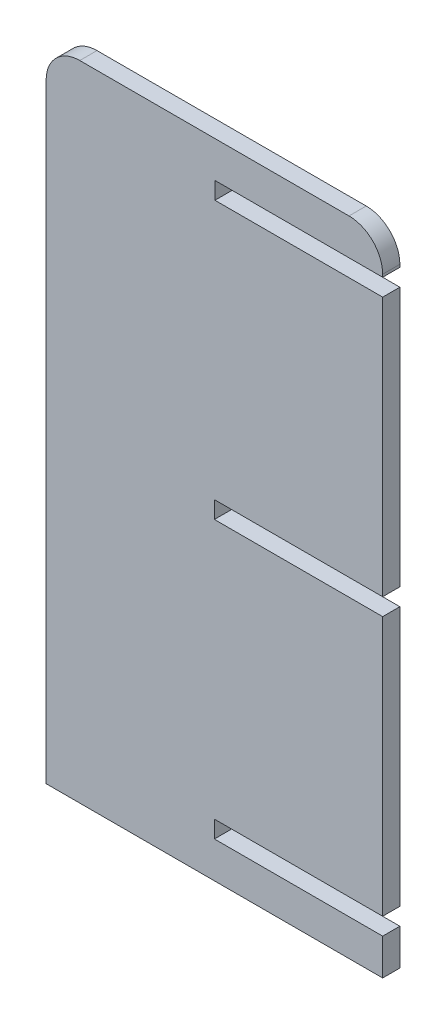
from build123d import *

# Parameters (mm, degrees)
SALIENTE_EXTRUIR1_DEPTH = 23


with BuildPart() as part:
    # Croquis1 → Saliente-Extruir1 (new body)
    with BuildSketch(Plane.XY):
        with BuildLine():
            Line((-222.670481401, -629.792443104), (227.329518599, -629.792443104))
            Line((227.329518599, -629.792443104), (227.329518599, -581.292443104))
            Line((227.329518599, -581.292443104), (2.329518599, -581.292443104))
            Line((2.329518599, -581.292443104), (2.329518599, -558.292443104))
            Line((2.329518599, -558.292443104), (227.329518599, -558.292443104))
            Line((227.329518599, -558.292443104), (227.329518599, -211.292443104))
            Line((227.329518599, -211.292443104), (2.329518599, -211.292443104))
            Line((2.329518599, -211.292443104), (2.329518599, -188.292443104))
            Line((2.329518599, -188.292443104), (227.329518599, -188.292443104))
            Line((227.329518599, -188.292443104), (227.329518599, 158.707556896))
            Line((227.329518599, 158.707556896), (3.032002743, 158.707556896))
            Line((3.032002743, 158.707556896), (3.032002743, 181.707556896))
            Line((3.032002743, 181.707556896), (227.329518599, 181.707556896))
            Line((227.329518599, 181.707556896), (227.329518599, 185.207556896))
            ThreePointArc((227.329518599, 185.207556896), (214.149323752, 217.02736205), (182.329518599, 230.207556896))
            Line((182.329518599, 230.207556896), (-177.670481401, 230.207556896))
            ThreePointArc((-177.670481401, 230.207556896), (-209.490286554, 217.02736205), (-222.670481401, 185.207556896))
            Line((-222.670481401, 185.207556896), (-222.670481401, -629.792443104))
        make_face()
    extrude(amount=SALIENTE_EXTRUIR1_DEPTH)


solid = part.part
